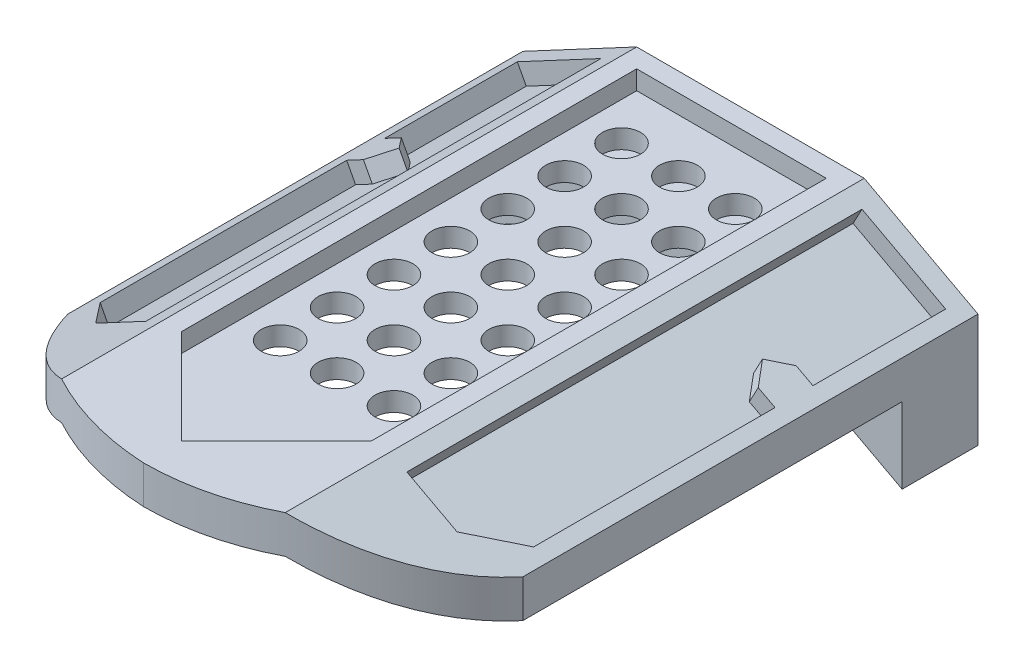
from build123d import *

# Parameters (mm, degrees)
BOSS_EXTRUDE1_DEPTH = 203.2
CUT_EXTRUDE1_DEPTH  = 60.96
CUT_EXTRUDE2_DEPTH  = 60.96
CUT_EXTRUDE3_DEPTH  = 6.35
CUT_EXTRUDE4_DEPTH  = 6.35
SKETCH9_W           = 63.5
SKETCH9_H           = 152.4
CUT_EXTRUDE5_DEPTH  = 6.35
CUT_EXTRUDE6_DEPTH  = 6.35
SKETCH11_R          = 6.35
CUT_EXTRUDE7_DEPTH  = 6.35
BOSS_EXTRUDE2_DEPTH = 25.4


with BuildPart() as part:
    # Sketch1 → Boss-Extrude1 (new body)
    with BuildSketch(Plane.XY):
        Polygon((0, 0), (0, 12.7), (38.1, 33.02), (114.3, 33.02), (152.4, 12.7), (152.4, 0), (114.3, 20.32), (38.1, 20.32), align=None)
    extrude(amount=BOSS_EXTRUDE1_DEPTH)

    # Sketch5 → Cut-Extrude1 (cut)
    with BuildSketch(Plane(origin=(0, 33.02, 0), x_dir=(1, 0, 0), z_dir=(0, 1, 0))):
        with BuildLine():
            Line((0, -152.4), (0, -203.2))
            Line((0, -203.2), (76.2, -203.2))
            ThreePointArc((76.2, -203.2), (31.072867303, -188.340699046), (0, -152.4))
        make_face()
    extrude(amount=-CUT_EXTRUDE1_DEPTH, mode=Mode.SUBTRACT)

    # Sketch6 → Cut-Extrude2 (cut)
    with BuildSketch(Plane(origin=(0, 33.02, 0), x_dir=(1, 0, 0), z_dir=(0, 1, 0))):
        with BuildLine():
            Line((76.2, -203.2), (152.4, -203.2))
            Line((152.4, -203.2), (152.4, -152.4))
            ThreePointArc((152.4, -152.4), (121.990501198, -189.335751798), (76.2, -203.2))
        make_face()
    extrude(amount=-CUT_EXTRUDE2_DEPTH, mode=Mode.SUBTRACT)

    # Sketch7 → Cut-Extrude3 (cut)
    with BuildSketch(Plane(origin=(-5.273356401, 9.887543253, 0), x_dir=(0.8823529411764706, 0.470588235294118, 0), z_dir=(-0.470588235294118, 0.8823529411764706, 0))):
        Polygon((11.056470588, -6.35), (11.056470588, -50.8), (17.406470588, -50.8), (23.756470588, -57.15), (17.406470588, -63.5), (11.056470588, -63.5), (11.056470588, -146.05), (23.756470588, -158.75), (42.806470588, -158.75), (42.806470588, -6.35), align=None)
    extrude(amount=-CUT_EXTRUDE3_DEPTH, mode=Mode.SUBTRACT)

    # Sketch8 → Cut-Extrude4 (cut)
    with BuildSketch(Plane(origin=(39.02283737, 73.167820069, 0), x_dir=(0.8823529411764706, -0.47058823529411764, 0), z_dir=(0.47058823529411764, 0.8823529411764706, 0))):
        Polygon((91.664117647, -6.35), (91.664117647, -158.75), (110.714117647, -158.75), (123.414117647, -144.334301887), (123.414117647, -63.5), (117.064117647, -63.5), (111.469868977, -57.15), (117.064117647, -50.8), (123.414117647, -50.8), (123.414117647, -6.35), align=None)
    extrude(amount=-CUT_EXTRUDE4_DEPTH, mode=Mode.SUBTRACT)

    # Sketch9 → Cut-Extrude5 (cut)
    with BuildSketch(Plane(origin=(0, 33.02, 0), x_dir=(1, 0, 0), z_dir=(0, 1, 0))):
        with Locations((76.2, -82.55)):
            Rectangle(SKETCH9_W, SKETCH9_H)
    extrude(amount=-CUT_EXTRUDE5_DEPTH, mode=Mode.SUBTRACT)

    # Sketch10 → Cut-Extrude6 (cut)
    with BuildSketch(Plane(origin=(0, 33.02, 0), x_dir=(1, 0, 0), z_dir=(0, 1, 0))):
        Polygon((44.45, -158.75), (107.95, -158.75), (76.2, -190.5), align=None)
    extrude(amount=-CUT_EXTRUDE6_DEPTH, mode=Mode.SUBTRACT)

    # Sketch11 → Cut-Extrude7 (cut)
    with BuildSketch(Plane(origin=(0, 26.67, 0), x_dir=(1, 0, 0), z_dir=(0, 1, 0))):
        with Locations(Location((57.15, -24.13, 0), (0, 0, 270))):
            Circle(SKETCH11_R)
        with Locations(Location((76.2, -24.13, 0), (0, 0, 270))):
            Circle(SKETCH11_R)
        with Locations(Location((95.25, -24.13, 0), (0, 0, 270))):
            Circle(SKETCH11_R)
        with Locations(Location((76.2, -43.18, 0), (0, 0, 270))):
            Circle(SKETCH11_R)
        with Locations(Location((95.25, -43.18, 0), (0, 0, 270))):
            Circle(SKETCH11_R)
        with Locations(Location((76.2, -62.23, 0), (0, 0, 270))):
            Circle(SKETCH11_R)
        with Locations(Location((95.25, -62.23, 0), (0, 0, 270))):
            Circle(SKETCH11_R)
        with Locations(Location((76.2, -81.28, 0), (0, 0, 270))):
            Circle(SKETCH11_R)
        with Locations(Location((95.25, -81.28, 0), (0, 0, 270))):
            Circle(SKETCH11_R)
        with Locations(Location((76.2, -100.33, 0), (0, 0, 270))):
            Circle(SKETCH11_R)
        with Locations(Location((95.25, -100.33, 0), (0, 0, 270))):
            Circle(SKETCH11_R)
        with Locations(Location((76.2, -119.38, 0), (0, 0, 270))):
            Circle(SKETCH11_R)
        with Locations(Location((95.25, -119.38, 0), (0, 0, 270))):
            Circle(SKETCH11_R)
        with Locations(Location((76.2, -138.43, 0), (0, 0, 270))):
            Circle(SKETCH11_R)
        with Locations(Location((95.25, -138.43, 0), (0, 0, 270))):
            Circle(SKETCH11_R)
        with Locations(Location((57.15, -43.18, 0), (0, 0, 270))):
            Circle(SKETCH11_R)
        with Locations(Location((57.15, -62.23, 0), (0, 0, 270))):
            Circle(SKETCH11_R)
        with Locations(Location((57.15, -81.28, 0), (0, 0, 270))):
            Circle(SKETCH11_R)
        with Locations(Location((57.15, -100.33, 0), (0, 0, 270))):
            Circle(SKETCH11_R)
        with Locations(Location((57.15, -119.38, 0), (0, 0, 270))):
            Circle(SKETCH11_R)
        with Locations(Location((57.15, -138.43, 0), (0, 0, 270))):
            Circle(SKETCH11_R)
    extrude(amount=-CUT_EXTRUDE7_DEPTH, mode=Mode.SUBTRACT)

    # Sketch12 → Boss-Extrude2 (add)
    with BuildSketch(Plane(origin=(0, 0, 0), x_dir=(-1, 0, 0), z_dir=(0, 0, -1))):
        Polygon((-152.4, 0), (-114.3, 20.32), (-38.1, 20.32), (0, 0), (0, -25.4), (-38.1, -5.08), (-114.3, -5.08), (-152.4, -25.4), align=None)
    extrude(amount=-BOSS_EXTRUDE2_DEPTH)


solid = part.part
